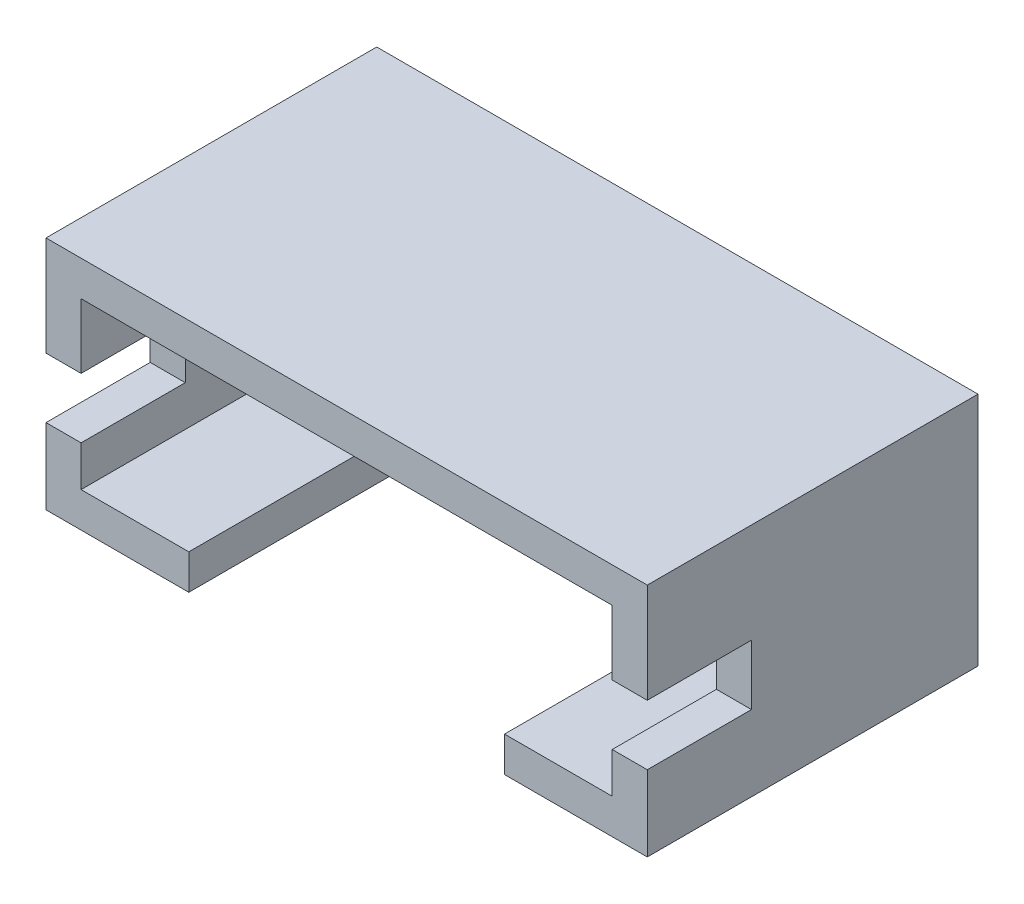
from build123d import *

# Parameters (mm, degrees)
ESQUISSE1_W             = 12
ESQUISSE1_H             = 4.7
EXTRUSION1_DEPTH        = 6.6
COQUE1_T                = -0.7
ESQUISSE2_W             = 2.07961519
ESQUISSE2_H             = 1.2
ENL_V_MAT_EXTRU_1_DEPTH = 15.479295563
ENL_V_MAT_EXTRU_2_REACH = 37.173
ESQUISSE3_W             = 6.3
ESQUISSE3_H             = 5.438100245
EXTRUSION2_DEPTH        = 3
EXTRUSION2_DEPTH_BACK   = 2
ESQUISSE4_R             = 0.302875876


with BuildPart() as part:
    # Esquisse1 → Extrusion1 (new body)
    with BuildSketch(Plane.XY):
        with Locations((28.22723449, 2.35)):
            Rectangle(ESQUISSE1_W, ESQUISSE1_H)
    extrude(amount=EXTRUSION1_DEPTH)

    # Coque1
    coque1_openings = [part.faces().sort_by_distance(p)[0] for p in [
        (28.22723449, 2.35, 6.6),
    ]]
    offset(amount=COQUE1_T, openings=coque1_openings, kind=Kind.INTERSECTION)

    # Esquisse2 → Enl_v. mat.-Extru.1 (cut, through all)
    with BuildSketch(Plane(origin=(34.22723449, 0, 0), x_dir=(0, 0, -1), z_dir=(1, 0, 0))):
        with Locations((-5.560192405, 2.108569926)):
            Rectangle(ESQUISSE2_W, ESQUISSE2_H)
    extrude(amount=-ENL_V_MAT_EXTRU_1_DEPTH, mode=Mode.SUBTRACT)

    # Esquisse3 → Enl_v. mat.-Extru.2 (cut, up to next)
    with BuildSketch(Plane.XZ, mode=Mode.PRIVATE) as enl_v_mat_extru_2_sk1:
        with Locations((28.22723449, 3.880949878)):
            Rectangle(ESQUISSE3_W, ESQUISSE3_H)
    enl_v_mat_extru_2_tool1 = extrude(enl_v_mat_extru_2_sk1.sketch, amount=-ENL_V_MAT_EXTRU_2_REACH, mode=Mode.PRIVATE) & part.part
    add(enl_v_mat_extru_2_tool1.solids().sort_by_distance((28.227234, 0, 3.88095))[0], mode=Mode.SUBTRACT)

    # Esquisse4 → Extrusion2 (add, two sides: drawn at the far end of the back side and taken through both)
    with BuildSketch(Plane.XY.offset(0.7).offset(-EXTRUSION2_DEPTH_BACK)):
        with Locations(Location((28.22723449, 2.35, 0), (0, 0, 180))):
            Circle(ESQUISSE4_R)
        with Locations(Location((30.242618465, 2.35, 0), (0, 0, 180))):
            Circle(ESQUISSE4_R)
        with Locations(Location((32.25800244, 2.35, 0), (0, 0, 180))):
            Circle(ESQUISSE4_R)
        with Locations(Location((26.242618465, 2.35, 0), (0, 0, 180))):
            Circle(ESQUISSE4_R)
        with Locations(Location((24.25800244, 2.35, 0), (0, 0, 180))):
            Circle(ESQUISSE4_R)
    extrude(amount=EXTRUSION2_DEPTH + EXTRUSION2_DEPTH_BACK)


solid = part.part
